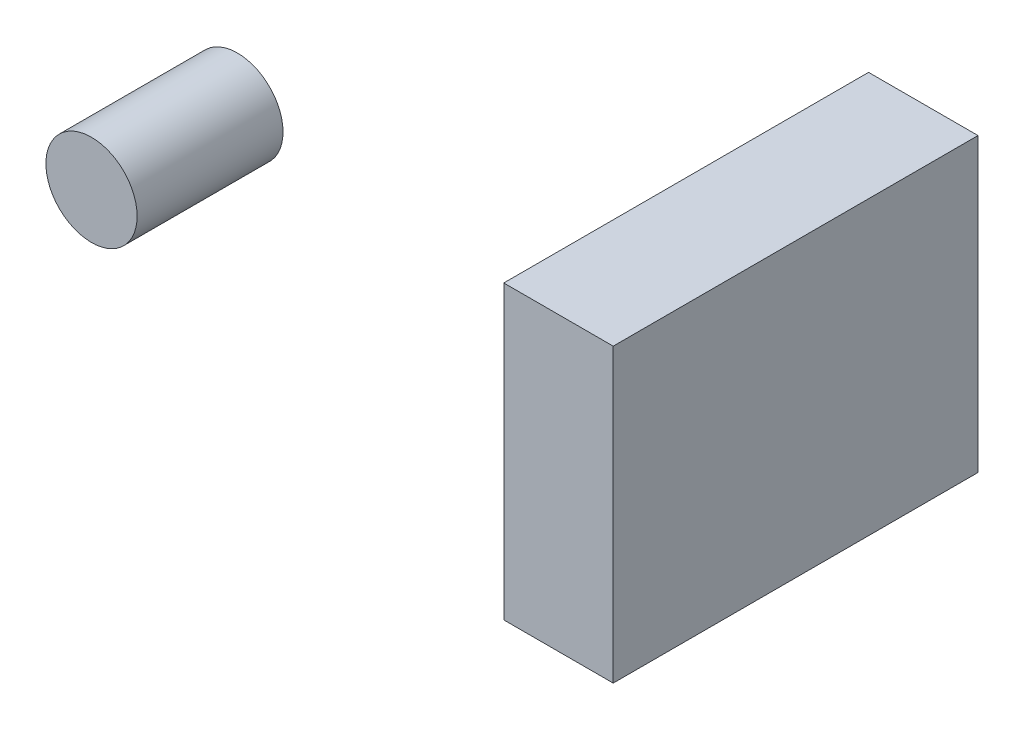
ISO-10303-21;
HEADER;
FILE_DESCRIPTION(('STEP AP214'),'2;1');
FILE_NAME('part.step','',(''),(''),'','','');
FILE_SCHEMA(('AUTOMOTIVE_DESIGN { 1 0 10303 214 1 1 1 1 }'));
ENDSEC;
DATA;
#1=APPLICATION_CONTEXT('core data for automotive mechanical design processes');
#2=APPLICATION_PROTOCOL_DEFINITION('international standard','automotive_design',2000,#1);
#3=PRODUCT_CONTEXT('',#1,'mechanical');
#4=PRODUCT('Part','Part','',(#3));
#5=PRODUCT_RELATED_PRODUCT_CATEGORY('part','',(#4));
#6=PRODUCT_DEFINITION_FORMATION('','',#4);
#7=PRODUCT_DEFINITION_CONTEXT('part definition',#1,'design');
#8=PRODUCT_DEFINITION('design','',#6,#7);
#9=PRODUCT_DEFINITION_SHAPE('','',#8);
#10=(LENGTH_UNIT() NAMED_UNIT(*) SI_UNIT(.MILLI.,.METRE.));
#11=(NAMED_UNIT(*) PLANE_ANGLE_UNIT() SI_UNIT($,.RADIAN.));
#12=(NAMED_UNIT(*) SI_UNIT($,.STERADIAN.) SOLID_ANGLE_UNIT());
#13=UNCERTAINTY_MEASURE_WITH_UNIT(LENGTH_MEASURE(1.E-05),#10,'distance_accuracy_value','');
#14=(GEOMETRIC_REPRESENTATION_CONTEXT(3) GLOBAL_UNCERTAINTY_ASSIGNED_CONTEXT((#13)) GLOBAL_UNIT_ASSIGNED_CONTEXT((#10,
#11,#12)) REPRESENTATION_CONTEXT('',''));
#15=CARTESIAN_POINT('',(0.,0.,0.));
#16=DIRECTION('',(0.,0.,1.));
#17=DIRECTION('',(1.,0.,0.));
#18=AXIS2_PLACEMENT_3D('',#15,#16,#17);
#19=CARTESIAN_POINT('',(27.484,-3.554,0.));
#20=DIRECTION('',(1.,0.,0.));
#21=DIRECTION('',(0.,0.,-1.));
#22=AXIS2_PLACEMENT_3D('',#19,#20,#21);
#23=PLANE('',#22);
#24=DIRECTION('',(0.,-1.,0.));
#25=VECTOR('',#24,1.);
#26=CARTESIAN_POINT('',(27.484,-3.554,-50.));
#27=LINE('',#26,#25);
#28=CARTESIAN_POINT('',(27.484,-3.554,-50.));
#29=VERTEX_POINT('',#28);
#30=CARTESIAN_POINT('',(27.484,-43.554,-50.));
#31=VERTEX_POINT('',#30);
#32=EDGE_CURVE('E114',#29,#31,#27,.T.);
#33=ORIENTED_EDGE('',*,*,#32,.T.);
#34=DIRECTION('',(0.,0.,-1.));
#35=VECTOR('',#34,1.);
#36=CARTESIAN_POINT('',(27.484,-43.554,0.));
#37=LINE('',#36,#35);
#38=CARTESIAN_POINT('',(27.484,-43.554,0.));
#39=VERTEX_POINT('',#38);
#40=EDGE_CURVE('E12',#39,#31,#37,.T.);
#41=ORIENTED_EDGE('',*,*,#40,.F.);
#42=DIRECTION('',(0.,-1.,0.));
#43=VECTOR('',#42,1.);
#44=CARTESIAN_POINT('',(27.484,-3.554,0.));
#45=LINE('',#44,#43);
#46=CARTESIAN_POINT('',(27.484,-3.554,0.));
#47=VERTEX_POINT('',#46);
#48=EDGE_CURVE('E102',#47,#39,#45,.T.);
#49=ORIENTED_EDGE('',*,*,#48,.F.);
#50=DIRECTION('',(0.,0.,-1.));
#51=VECTOR('',#50,1.);
#52=CARTESIAN_POINT('',(27.484,-3.554,0.));
#53=LINE('',#52,#51);
#54=EDGE_CURVE('E110',#47,#29,#53,.T.);
#55=ORIENTED_EDGE('',*,*,#54,.T.);
#56=EDGE_LOOP('',(#33,#41,#49,#55));
#57=FACE_BOUND('',#56,.T.);
#58=ADVANCED_FACE('F51',(#57),#23,.F.);
#59=CARTESIAN_POINT('',(27.484,-43.554,0.));
#60=DIRECTION('',(0.,1.,0.));
#61=DIRECTION('',(0.,0.,1.));
#62=AXIS2_PLACEMENT_3D('',#59,#60,#61);
#63=PLANE('',#62);
#64=DIRECTION('',(1.,0.,0.));
#65=VECTOR('',#64,1.);
#66=CARTESIAN_POINT('',(27.484,-43.554,-50.));
#67=LINE('',#66,#65);
#68=CARTESIAN_POINT('',(42.484,-43.554,-50.));
#69=VERTEX_POINT('',#68);
#70=EDGE_CURVE('E106',#31,#69,#67,.T.);
#71=ORIENTED_EDGE('',*,*,#70,.T.);
#72=DIRECTION('',(0.,0.,-1.));
#73=VECTOR('',#72,1.);
#74=CARTESIAN_POINT('',(42.484,-43.554,0.));
#75=LINE('',#74,#73);
#76=CARTESIAN_POINT('',(42.484,-43.554,0.));
#77=VERTEX_POINT('',#76);
#78=EDGE_CURVE('E59',#77,#69,#75,.T.);
#79=ORIENTED_EDGE('',*,*,#78,.F.);
#80=DIRECTION('',(1.,0.,0.));
#81=VECTOR('',#80,1.);
#82=CARTESIAN_POINT('',(27.484,-43.554,0.));
#83=LINE('',#82,#81);
#84=EDGE_CURVE('E97',#39,#77,#83,.T.);
#85=ORIENTED_EDGE('',*,*,#84,.F.);
#86=ORIENTED_EDGE('',*,*,#40,.T.);
#87=EDGE_LOOP('',(#71,#79,#85,#86));
#88=FACE_BOUND('',#87,.T.);
#89=ADVANCED_FACE('F105',(#88),#63,.F.);
#90=CARTESIAN_POINT('',(42.484,-43.554,0.));
#91=DIRECTION('',(-1.,0.,0.));
#92=DIRECTION('',(0.,0.,1.));
#93=AXIS2_PLACEMENT_3D('',#90,#91,#92);
#94=PLANE('',#93);
#95=DIRECTION('',(0.,1.,0.));
#96=VECTOR('',#95,1.);
#97=CARTESIAN_POINT('',(42.484,-43.554,-50.));
#98=LINE('',#97,#96);
#99=CARTESIAN_POINT('',(42.484,-3.554,-50.));
#100=VERTEX_POINT('',#99);
#101=EDGE_CURVE('E84',#69,#100,#98,.T.);
#102=ORIENTED_EDGE('',*,*,#101,.T.);
#103=DIRECTION('',(0.,0.,-1.));
#104=VECTOR('',#103,1.);
#105=CARTESIAN_POINT('',(42.484,-3.554,0.));
#106=LINE('',#105,#104);
#107=CARTESIAN_POINT('',(42.484,-3.554,0.));
#108=VERTEX_POINT('',#107);
#109=EDGE_CURVE('E107',#108,#100,#106,.T.);
#110=ORIENTED_EDGE('',*,*,#109,.F.);
#111=DIRECTION('',(0.,1.,0.));
#112=VECTOR('',#111,1.);
#113=CARTESIAN_POINT('',(42.484,-43.554,0.));
#114=LINE('',#113,#112);
#115=EDGE_CURVE('E100',#77,#108,#114,.T.);
#116=ORIENTED_EDGE('',*,*,#115,.F.);
#117=ORIENTED_EDGE('',*,*,#78,.T.);
#118=EDGE_LOOP('',(#102,#110,#116,#117));
#119=FACE_BOUND('',#118,.T.);
#120=ADVANCED_FACE('F108',(#119),#94,.F.);
#121=CARTESIAN_POINT('',(42.484,-3.554,0.));
#122=DIRECTION('',(0.,-1.,0.));
#123=DIRECTION('',(0.,0.,-1.));
#124=AXIS2_PLACEMENT_3D('',#121,#122,#123);
#125=PLANE('',#124);
#126=DIRECTION('',(-1.,0.,0.));
#127=VECTOR('',#126,1.);
#128=CARTESIAN_POINT('',(42.484,-3.554,-50.));
#129=LINE('',#128,#127);
#130=EDGE_CURVE('E90',#100,#29,#129,.T.);
#131=ORIENTED_EDGE('',*,*,#130,.T.);
#132=ORIENTED_EDGE('',*,*,#54,.F.);
#133=DIRECTION('',(-1.,0.,0.));
#134=VECTOR('',#133,1.);
#135=CARTESIAN_POINT('',(42.484,-3.554,0.));
#136=LINE('',#135,#134);
#137=EDGE_CURVE('E67',#108,#47,#136,.T.);
#138=ORIENTED_EDGE('',*,*,#137,.F.);
#139=ORIENTED_EDGE('',*,*,#109,.T.);
#140=EDGE_LOOP('',(#131,#132,#138,#139));
#141=FACE_BOUND('',#140,.T.);
#142=ADVANCED_FACE('F121',(#141),#125,.F.);
#143=CARTESIAN_POINT('',(0.,0.,0.));
#144=DIRECTION('',(0.,0.,1.));
#145=DIRECTION('',(1.,0.,0.));
#146=AXIS2_PLACEMENT_3D('',#143,#144,#145);
#147=PLANE('',#146);
#148=ORIENTED_EDGE('',*,*,#48,.T.);
#149=ORIENTED_EDGE('',*,*,#84,.T.);
#150=ORIENTED_EDGE('',*,*,#115,.T.);
#151=ORIENTED_EDGE('',*,*,#137,.T.);
#152=EDGE_LOOP('',(#148,#149,#150,#151));
#153=FACE_BOUND('',#152,.T.);
#154=ADVANCED_FACE('F98',(#153),#147,.T.);
#155=CARTESIAN_POINT('',(0.,0.,-50.));
#156=DIRECTION('',(0.,0.,1.));
#157=DIRECTION('',(1.,0.,0.));
#158=AXIS2_PLACEMENT_3D('',#155,#156,#157);
#159=PLANE('',#158);
#160=ORIENTED_EDGE('',*,*,#32,.F.);
#161=ORIENTED_EDGE('',*,*,#130,.F.);
#162=ORIENTED_EDGE('',*,*,#101,.F.);
#163=ORIENTED_EDGE('',*,*,#70,.F.);
#164=EDGE_LOOP('',(#160,#161,#162,#163));
#165=FACE_BOUND('',#164,.T.);
#166=ADVANCED_FACE('F124',(#165),#159,.F.);
#167=CLOSED_SHELL('',(#58,#89,#120,#142,#154,#166));
#168=MANIFOLD_SOLID_BREP('B2',#167);
#169=CARTESIAN_POINT('',(-29.024,-20.76,0.));
#170=DIRECTION('',(0.,0.,-1.));
#171=DIRECTION('',(-1.,0.,0.));
#172=AXIS2_PLACEMENT_3D('',#169,#170,#171);
#173=CYLINDRICAL_SURFACE('',#172,6.25);
#174=CARTESIAN_POINT('',(-29.024,-20.76,0.));
#175=DIRECTION('',(0.,0.,1.));
#176=DIRECTION('',(1.,0.,0.));
#177=AXIS2_PLACEMENT_3D('',#174,#175,#176);
#178=CIRCLE('',#177,6.25);
#179=CARTESIAN_POINT('',(-22.774,-20.76,0.));
#180=VERTEX_POINT('',#179);
#181=EDGE_CURVE('E50',#180,#180,#178,.T.);
#182=ORIENTED_EDGE('',*,*,#181,.F.);
#183=EDGE_LOOP('',(#182));
#184=FACE_BOUND('',#183,.T.);
#185=CARTESIAN_POINT('',(-29.024,-20.76,-20.));
#186=DIRECTION('',(0.,0.,1.));
#187=DIRECTION('',(1.,0.,0.));
#188=AXIS2_PLACEMENT_3D('',#185,#186,#187);
#189=CIRCLE('',#188,6.25);
#190=CARTESIAN_POINT('',(-22.774,-20.76,-20.));
#191=VERTEX_POINT('',#190);
#192=EDGE_CURVE('E178',#191,#191,#189,.T.);
#193=ORIENTED_EDGE('',*,*,#192,.T.);
#194=EDGE_LOOP('',(#193));
#195=FACE_BOUND('',#194,.T.);
#196=ADVANCED_FACE('F175',(#184,#195),#173,.T.);
#197=CARTESIAN_POINT('',(-29.024,-20.76,0.));
#198=DIRECTION('',(0.,0.,1.));
#199=DIRECTION('',(1.,0.,0.));
#200=AXIS2_PLACEMENT_3D('',#197,#198,#199);
#201=PLANE('',#200);
#202=ORIENTED_EDGE('',*,*,#181,.T.);
#203=EDGE_LOOP('',(#202));
#204=FACE_BOUND('',#203,.T.);
#205=ADVANCED_FACE('F190',(#204),#201,.T.);
#206=CARTESIAN_POINT('',(-29.024,-20.76,-20.));
#207=DIRECTION('',(0.,0.,1.));
#208=DIRECTION('',(1.,0.,0.));
#209=AXIS2_PLACEMENT_3D('',#206,#207,#208);
#210=PLANE('',#209);
#211=ORIENTED_EDGE('',*,*,#192,.F.);
#212=EDGE_LOOP('',(#211));
#213=FACE_BOUND('',#212,.T.);
#214=ADVANCED_FACE('F188',(#213),#210,.F.);
#215=CLOSED_SHELL('',(#196,#205,#214));
#216=MANIFOLD_SOLID_BREP('B6',#215);
#217=ADVANCED_BREP_SHAPE_REPRESENTATION('',(#18,#168,#216),#14);
#218=SHAPE_DEFINITION_REPRESENTATION(#9,#217);
ENDSEC;
END-ISO-10303-21;
